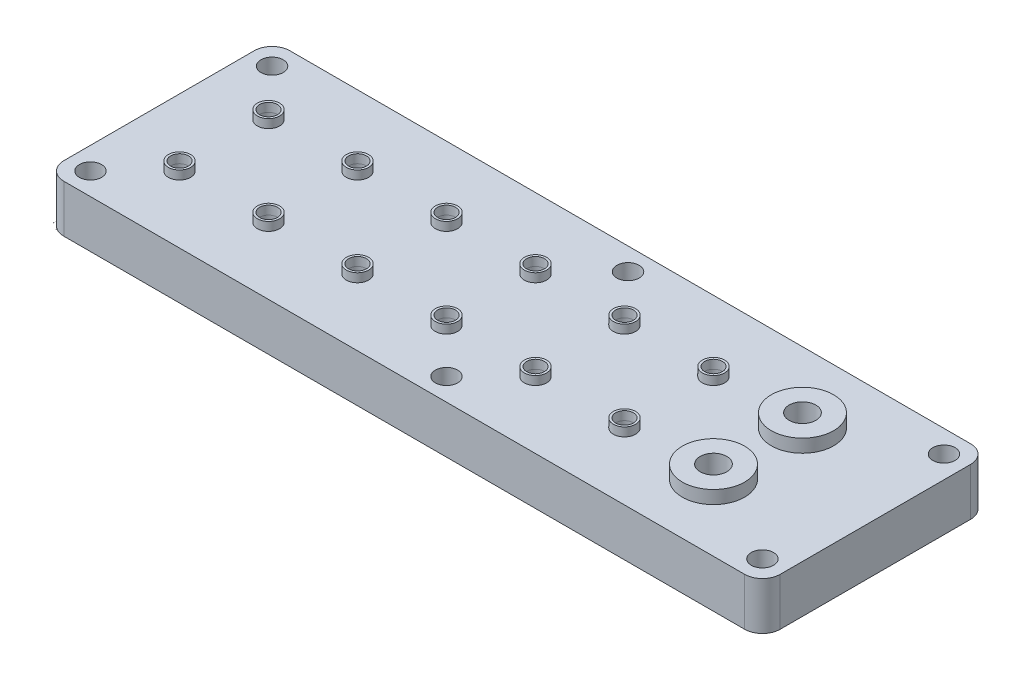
from build123d import *

# Parameters (mm, degrees)
SKETCH1_W                 = 161
SKETCH1_H                 = 50.8
BOSS_EXTRUDE1_DEPTH       = 10.7
CUT_EXTRUDE2_DEPTH        = 1.45
CUT_EXTRUDE2_DEPTH_BACK   = 170.163027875
SKETCH2_R                 = 2
CUT_EXTRUDE3_DEPTH        = 3.5
SKETCH4_R                 = 2.5
SKETCH4_R_2               = 6.99826734
SKETCH4_R_3               = 7
BOSS_EXTRUDE5_DEPTH       = 1.95
SKETCH6_R                 = 2
CUT_EXTRUDE5_DEPTH        = 1.95
CUT_EXTRUDE7_DEPTH        = 3.22
FILLET1_R                 = 4
F_5_0MM_DOWEL_HOLE1_D     = 5
SKETCH10_R                = 7
SKETCH10_R_2              = 6.99826734
BOSS_EXTRUDE6_DEPTH       = 1
F_6_0MM_DOWEL_HOLE1_D     = 6
F_6_0MM_DOWEL_HOLE1_DEPTH = 7
F_6_0MM_DOWEL_HOLE1_TIP   = 1.802581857


with BuildPart() as part:
    # Sketch1 → Boss-Extrude1 (new body)
    with BuildSketch(Plane(origin=(0, 0, 0), x_dir=(1, 0, 0), z_dir=(0, 1, 0))):
        with Locations((80.5, 25.4)):
            Rectangle(SKETCH1_W, SKETCH1_H)
    extrude(amount=BOSS_EXTRUDE1_DEPTH)

    # Sketch2 → Cut-Extrude2 (cut, two sides: drawn at the far end of the back side and taken through both)
    with BuildSketch(Plane(origin=(0, 10.7, 0), x_dir=(1, 0, 0), z_dir=(0, 1, 0)).offset(-CUT_EXTRUDE2_DEPTH_BACK)):
        with Locations(Location((15, 15, 0), (0, 0, 90))):
            Circle(SKETCH2_R)
        with Locations(Location((15, 35, 0), (0, 0, 90))):
            Circle(SKETCH2_R)
        with Locations(Location((35, 15, 0), (0, 0, 90))):
            Circle(SKETCH2_R)
        with Locations(Location((35, 35, 0), (0, 0, 90))):
            Circle(SKETCH2_R)
        with Locations(Location((55, 35, 0), (0, 0, 90))):
            Circle(SKETCH2_R)
        with Locations(Location((55, 15, 0), (0, 0, 90))):
            Circle(SKETCH2_R)
        with Locations(Location((75, 35, 0), (0, 0, 90))):
            Circle(SKETCH2_R)
        with Locations(Location((75, 15, 0), (0, 0, 90))):
            Circle(SKETCH2_R)
        with Locations(Location((95, 35, 0), (0, 0, 90))):
            Circle(SKETCH2_R)
        with Locations(Location((95, 15, 0), (0, 0, 90))):
            Circle(SKETCH2_R)
        with Locations(Location((115, 35, 0), (0, 0, 90))):
            Circle(SKETCH2_R)
        with Locations(Location((115, 15, 0), (0, 0, 90))):
            Circle(SKETCH2_R)
        with Locations(Location((135, 35, 0), (0, 0, 90))):
            Circle(SKETCH2_R)
        with Locations(Location((135, 15, 0), (0, 0, 90))):
            Circle(SKETCH2_R)
    extrude(amount=CUT_EXTRUDE2_DEPTH + CUT_EXTRUDE2_DEPTH_BACK, mode=Mode.SUBTRACT)

    # Sketch3 → Cut-Extrude3 (cut)
    with BuildSketch(Plane(origin=(0, 0, 0), x_dir=(-1, 0, 0), z_dir=(0, -1, 0))):
        with BuildLine():
            Line((-14.5, 12.5), (-135.5, 12.5))
            ThreePointArc((-135.5, 12.5), (-136.914213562, 13.085786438), (-137.5, 14.5))
            Line((-137.5, 14.5), (-137.5, 15.5))
            ThreePointArc((-137.5, 15.5), (-136.914213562, 16.914213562), (-135.5, 17.5))
            Line((-135.5, 17.5), (-14.5, 17.5))
            ThreePointArc((-14.5, 17.5), (-13.085786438, 16.914213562), (-12.5, 15.5))
            Line((-12.5, 15.5), (-12.5, 14.5))
            ThreePointArc((-12.5, 14.5), (-13.085786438, 13.085786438), (-14.5, 12.5))
        make_face()
        with BuildLine():
            Line((-14.5, 32.5), (-135.5, 32.5))
            ThreePointArc((-135.5, 32.5), (-136.914213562, 33.085786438), (-137.5, 34.5))
            Line((-137.5, 34.5), (-137.5, 35.5))
            ThreePointArc((-137.5, 35.5), (-136.914213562, 36.914213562), (-135.5, 37.5))
            Line((-135.5, 37.5), (-14.5, 37.5))
            ThreePointArc((-14.5, 37.5), (-13.085786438, 36.914213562), (-12.5, 35.5))
            Line((-12.5, 35.5), (-12.5, 34.5))
            ThreePointArc((-12.5, 34.5), (-13.085786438, 33.085786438), (-14.5, 32.5))
        make_face()
    extrude(amount=-CUT_EXTRUDE3_DEPTH, mode=Mode.SUBTRACT)

    # Sketch4 → Boss-Extrude5 (add)
    with BuildSketch(Plane(origin=(0, 10.7, 0), x_dir=(1, 0, 0), z_dir=(0, 1, 0))):
        with Locations(Location((15, 35, 0), (0, 0, 90))):
            Circle(SKETCH4_R)
        with Locations(Location((15, 15, 0), (0, 0, 90))):
            Circle(SKETCH4_R)
        with Locations(Location((35, 35, 0), (0, 0, 90))):
            Circle(SKETCH4_R)
        with Locations(Location((35, 15, 0), (0, 0, 90))):
            Circle(SKETCH4_R)
        with Locations(Location((55, 35, 0), (0, 0, 90))):
            Circle(SKETCH4_R)
        with Locations(Location((55, 15, 0), (0, 0, 90))):
            Circle(SKETCH4_R)
        with Locations(Location((75, 35, 0), (0, 0, 90))):
            Circle(SKETCH4_R)
        with Locations(Location((75, 15, 0), (0, 0, 90))):
            Circle(SKETCH4_R)
        with Locations(Location((95, 35, 0), (0, 0, 90))):
            Circle(SKETCH4_R)
        with Locations(Location((115, 15, 0), (0, 0, 90))):
            Circle(SKETCH4_R)
        with Locations(Location((115, 35, 0), (0, 0, 90))):
            Circle(SKETCH4_R)
        with Locations(Location((95, 15, 0), (0, 0, 90))):
            Circle(SKETCH4_R)
        with Locations(Location((135, 15, 0), (0, 0, 90))):
            Circle(SKETCH4_R_2)
        with Locations(Location((135, 35, 0), (0, 0, 90))):
            Circle(SKETCH4_R_3)
    extrude(amount=BOSS_EXTRUDE5_DEPTH)

    # Sketch6 → Cut-Extrude5 (cut)
    with BuildSketch(Plane(origin=(0, 12.65, 0), x_dir=(1, 0, 0), z_dir=(0, 1, 0))):
        with Locations(Location((15.011898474, 14.996675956, 0), (0, 0, 270))):
            Circle(SKETCH6_R)
        with Locations(Location((15.011898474, 34.996675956, 0), (0, 0, 270))):
            Circle(SKETCH6_R)
        with Locations(Location((35.011898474, 14.996675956, 0), (0, 0, 270))):
            Circle(SKETCH6_R)
        with Locations(Location((35.011898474, 34.996675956, 0), (0, 0, 270))):
            Circle(SKETCH6_R)
        with Locations(Location((55.011898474, 34.996675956, 0), (0, 0, 270))):
            Circle(SKETCH6_R)
        with Locations(Location((55.011898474, 14.996675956, 0), (0, 0, 270))):
            Circle(SKETCH6_R)
        with Locations(Location((75.011898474, 34.996675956, 0), (0, 0, 270))):
            Circle(SKETCH6_R)
        with Locations(Location((75.011898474, 14.996675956, 0), (0, 0, 270))):
            Circle(SKETCH6_R)
        with Locations(Location((95.011898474, 34.996675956, 0), (0, 0, 270))):
            Circle(SKETCH6_R)
        with Locations(Location((95.011898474, 14.996675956, 0), (0, 0, 270))):
            Circle(SKETCH6_R)
        with Locations(Location((115.011898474, 34.996675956, 0), (0, 0, 270))):
            Circle(SKETCH6_R)
        with Locations(Location((115.011898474, 14.996675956, 0), (0, 0, 270))):
            Circle(SKETCH6_R)
        with Locations(Location((135.011898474, 34.996675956, 0), (0, 0, 270))):
            Circle(SKETCH6_R)
        with Locations(Location((135.011898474, 14.996675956, 0), (0, 0, 270))):
            Circle(SKETCH6_R)
    extrude(amount=-CUT_EXTRUDE5_DEPTH, mode=Mode.SUBTRACT)

    # Sketch7 → Cut-Extrude7 (cut)
    with BuildSketch(Plane(origin=(0, 0, 0), x_dir=(-1, 0, 0), z_dir=(0, -1, 0))):
        with BuildLine():
            Line((-6.5, 6.75), (-154.5, 6.75))
            ThreePointArc((-154.5, 6.75), (-156.5, 8.75), (-154.5, 10.75))
            Line((-154.5, 10.75), (-6.5, 10.75))
            ThreePointArc((-6.5, 10.75), (-4.5, 8.75), (-6.5, 6.75))
        make_face()
        with BuildLine():
            Line((-8.5, 8.75), (-8.5, 21.25))
            ThreePointArc((-8.5, 21.25), (-6.5, 23.25), (-4.5, 21.25))
            Line((-4.5, 21.25), (-4.5, 8.75))
            ThreePointArc((-4.5, 8.75), (-6.5, 6.75), (-8.5, 8.75))
        make_face()
        with BuildLine():
            Line((-6.5, 19.25), (-154.5, 19.25))
            ThreePointArc((-154.5, 19.25), (-156.5, 21.25), (-154.5, 23.25))
            Line((-154.5, 23.25), (-6.5, 23.25))
            ThreePointArc((-6.5, 23.25), (-4.5, 21.25), (-6.5, 19.25))
        make_face()
        with BuildLine():
            Line((-152.5, 21.25), (-152.5, 8.75))
            ThreePointArc((-152.5, 8.75), (-154.5, 6.75), (-156.5, 8.75))
            Line((-156.5, 8.75), (-156.5, 21.25))
            ThreePointArc((-156.5, 21.25), (-154.5, 23.25), (-152.5, 21.25))
        make_face()
        with BuildLine():
            Line((-6.5, 26.75), (-154.5, 26.75))
            ThreePointArc((-154.5, 26.75), (-156.5, 28.75), (-154.5, 30.75))
            Line((-154.5, 30.75), (-6.5, 30.75))
            ThreePointArc((-6.5, 30.75), (-4.5, 28.75), (-6.5, 26.75))
        make_face()
        with BuildLine():
            Line((-8.5, 28.75), (-8.5, 41.25))
            ThreePointArc((-8.5, 41.25), (-6.5, 43.25), (-4.5, 41.25))
            Line((-4.5, 41.25), (-4.5, 28.75))
            ThreePointArc((-4.5, 28.75), (-6.5, 26.75), (-8.5, 28.75))
        make_face()
        with BuildLine():
            Line((-6.5, 39.25), (-154.5, 39.25))
            ThreePointArc((-154.5, 39.25), (-156.5, 41.25), (-154.5, 43.25))
            Line((-154.5, 43.25), (-6.5, 43.25))
            ThreePointArc((-6.5, 43.25), (-4.5, 41.25), (-6.5, 39.25))
        make_face()
        with BuildLine():
            Line((-152.5, 41.25), (-152.5, 28.75))
            ThreePointArc((-152.5, 28.75), (-154.5, 26.75), (-156.5, 28.75))
            Line((-156.5, 28.75), (-156.5, 41.25))
            ThreePointArc((-156.5, 41.25), (-154.5, 43.25), (-152.5, 41.25))
        make_face()
    extrude(amount=-CUT_EXTRUDE7_DEPTH, mode=Mode.SUBTRACT)

    # Fillet1
    fillet1_edges = [part.edges().sort_by_distance(p)[0] for p in [
        (0, 5.35, -50.8),
        (161, 5.35, -50.8),
        (161, 5.35, 0),
        (0, 5.35, 0),
    ]]
    fillet(fillet1_edges, radius=FILLET1_R)

    # 5.0mm Dowel Hole1 (through all)
    with Locations(Plane(origin=(0, 0, 0), x_dir=(-1, 0, 0), z_dir=(0, -1, 0))):
        with Locations((-5, 45.8), (-85, 45.8), (-156, 45.8), (-156, 5), (-85, 5), (-5, 5)):
            Hole(F_5_0MM_DOWEL_HOLE1_D / 2)

    # Sketch10 → Boss-Extrude6 (add)
    with BuildSketch(Plane(origin=(0, 12.65, 0), x_dir=(1, 0, 0), z_dir=(0, 1, 0))):
        with Locations(Location((135, 35, 0), (0, 0, 90))):
            Circle(SKETCH10_R)
        with Locations(Location((135, 15, 0), (0, 0, 90))):
            Circle(SKETCH10_R_2)
    extrude(amount=BOSS_EXTRUDE6_DEPTH)

    # 6.0mm Dowel Hole1
    with Locations(Plane(origin=(0, 13.65, 0), x_dir=(1, 0, 0), z_dir=(0, 1, 0))):
        with Locations((135, 35), (135, 15)):
            Hole(F_6_0MM_DOWEL_HOLE1_D / 2, depth=F_6_0MM_DOWEL_HOLE1_DEPTH)
            with Locations((0, 0, -(F_6_0MM_DOWEL_HOLE1_DEPTH + F_6_0MM_DOWEL_HOLE1_TIP / 2))):  # 118° drill point
                Cone(0, F_6_0MM_DOWEL_HOLE1_D / 2, F_6_0MM_DOWEL_HOLE1_TIP, mode=Mode.SUBTRACT)


solid = part.part
